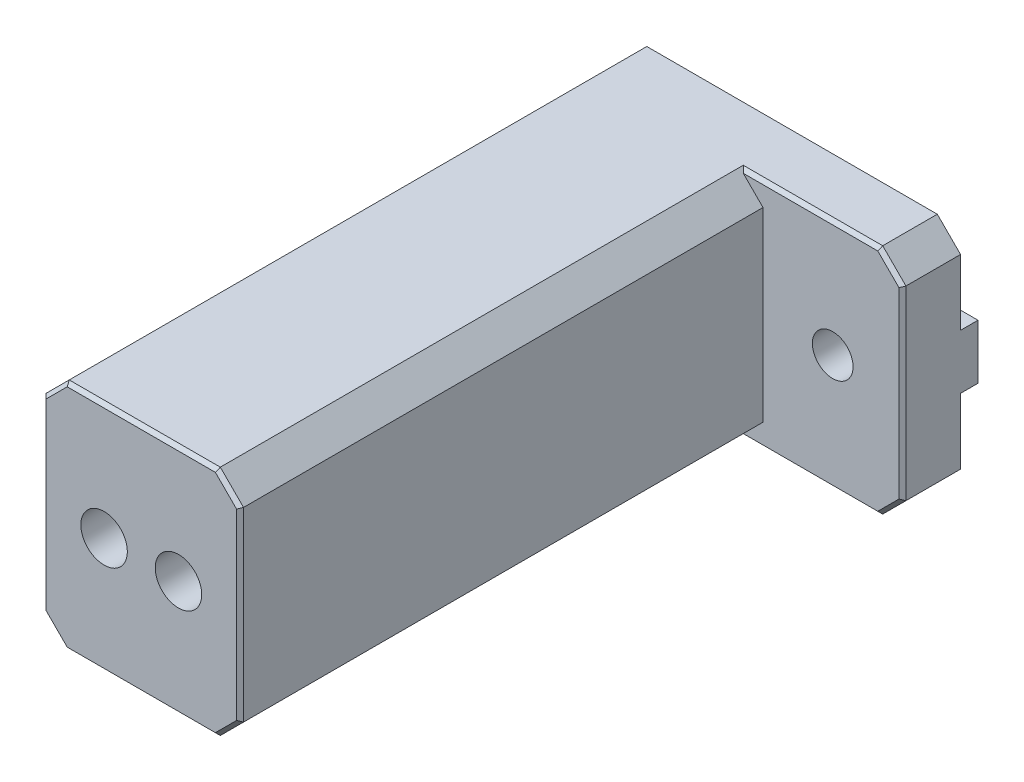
ISO-10303-21;
HEADER;
FILE_DESCRIPTION(('STEP AP214'),'2;1');
FILE_NAME('part.step','',(''),(''),'','','');
FILE_SCHEMA(('AUTOMOTIVE_DESIGN { 1 0 10303 214 1 1 1 1 }'));
ENDSEC;
DATA;
#1=APPLICATION_CONTEXT('core data for automotive mechanical design processes');
#2=APPLICATION_PROTOCOL_DEFINITION('international standard','automotive_design',2000,#1);
#3=PRODUCT_CONTEXT('',#1,'mechanical');
#4=PRODUCT('Part','Part','',(#3));
#5=PRODUCT_RELATED_PRODUCT_CATEGORY('part','',(#4));
#6=PRODUCT_DEFINITION_FORMATION('','',#4);
#7=PRODUCT_DEFINITION_CONTEXT('part definition',#1,'design');
#8=PRODUCT_DEFINITION('design','',#6,#7);
#9=PRODUCT_DEFINITION_SHAPE('','',#8);
#10=(LENGTH_UNIT() NAMED_UNIT(*) SI_UNIT(.MILLI.,.METRE.));
#11=(NAMED_UNIT(*) PLANE_ANGLE_UNIT() SI_UNIT($,.RADIAN.));
#12=(NAMED_UNIT(*) SI_UNIT($,.STERADIAN.) SOLID_ANGLE_UNIT());
#13=UNCERTAINTY_MEASURE_WITH_UNIT(LENGTH_MEASURE(1.E-05),#10,'distance_accuracy_value','');
#14=(GEOMETRIC_REPRESENTATION_CONTEXT(3) GLOBAL_UNCERTAINTY_ASSIGNED_CONTEXT((#13)) GLOBAL_UNIT_ASSIGNED_CONTEXT((#10,
#11,#12)) REPRESENTATION_CONTEXT('',''));
#15=CARTESIAN_POINT('',(0.,0.,0.));
#16=DIRECTION('',(0.,0.,1.));
#17=DIRECTION('',(1.,0.,0.));
#18=AXIS2_PLACEMENT_3D('',#15,#16,#17);
#19=CARTESIAN_POINT('',(14.5,-10.,50.));
#20=DIRECTION('',(-1.,0.,0.));
#21=DIRECTION('',(0.,0.,1.));
#22=AXIS2_PLACEMENT_3D('',#19,#20,#21);
#23=PLANE('',#22);
#24=DIRECTION('',(0.,0.,1.));
#25=VECTOR('',#24,1.);
#26=CARTESIAN_POINT('',(14.5,7.99999999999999,50.));
#27=LINE('',#26,#25);
#28=CARTESIAN_POINT('',(14.5,7.99999999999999,0.));
#29=VERTEX_POINT('',#28);
#30=CARTESIAN_POINT('',(14.5,7.99999999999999,4.7));
#31=VERTEX_POINT('',#30);
#32=EDGE_CURVE('E274',#29,#31,#27,.T.);
#33=ORIENTED_EDGE('',*,*,#32,.T.);
#34=DIRECTION('',(0.,-1.,0.));
#35=VECTOR('',#34,1.);
#36=CARTESIAN_POINT('',(14.5,-8.,4.7));
#37=LINE('',#36,#35);
#38=CARTESIAN_POINT('',(14.5,-8.,4.7));
#39=VERTEX_POINT('',#38);
#40=EDGE_CURVE('E340',#31,#39,#37,.T.);
#41=ORIENTED_EDGE('',*,*,#40,.T.);
#42=DIRECTION('',(0.,0.,-1.));
#43=VECTOR('',#42,1.);
#44=CARTESIAN_POINT('',(14.5,-8.,50.));
#45=LINE('',#44,#43);
#46=CARTESIAN_POINT('',(14.5,-8.,0.));
#47=VERTEX_POINT('',#46);
#48=EDGE_CURVE('E271',#39,#47,#45,.T.);
#49=ORIENTED_EDGE('',*,*,#48,.T.);
#50=DIRECTION('',(0.,1.,0.));
#51=VECTOR('',#50,1.);
#52=CARTESIAN_POINT('',(14.5,-10.,0.));
#53=LINE('',#52,#51);
#54=CARTESIAN_POINT('',(14.5,-2.35,0.));
#55=VERTEX_POINT('',#54);
#56=EDGE_CURVE('E237',#47,#55,#53,.T.);
#57=ORIENTED_EDGE('',*,*,#56,.T.);
#58=DIRECTION('',(0.,0.,1.));
#59=VECTOR('',#58,1.);
#60=CARTESIAN_POINT('',(14.5,-2.35,-1.5));
#61=LINE('',#60,#59);
#62=CARTESIAN_POINT('',(14.5,-2.35,-1.5));
#63=VERTEX_POINT('',#62);
#64=EDGE_CURVE('E239',#63,#55,#61,.T.);
#65=ORIENTED_EDGE('',*,*,#64,.F.);
#66=DIRECTION('',(0.,-1.,0.));
#67=VECTOR('',#66,1.);
#68=CARTESIAN_POINT('',(14.5,-2.35,-1.5));
#69=LINE('',#68,#67);
#70=CARTESIAN_POINT('',(14.5,2.35,-1.5));
#71=VERTEX_POINT('',#70);
#72=EDGE_CURVE('E213',#71,#63,#69,.T.);
#73=ORIENTED_EDGE('',*,*,#72,.F.);
#74=DIRECTION('',(0.,0.,1.));
#75=VECTOR('',#74,1.);
#76=CARTESIAN_POINT('',(14.5,2.35,-1.5));
#77=LINE('',#76,#75);
#78=CARTESIAN_POINT('',(14.5,2.35,0.));
#79=VERTEX_POINT('',#78);
#80=EDGE_CURVE('E209',#71,#79,#77,.T.);
#81=ORIENTED_EDGE('',*,*,#80,.T.);
#82=EDGE_CURVE('E231',#79,#29,#53,.T.);
#83=ORIENTED_EDGE('',*,*,#82,.T.);
#84=EDGE_LOOP('',(#33,#41,#49,#57,#65,#73,#81,#83));
#85=FACE_BOUND('',#84,.T.);
#86=ADVANCED_FACE('F40',(#85),#23,.F.);
#87=CARTESIAN_POINT('',(0.,0.,0.));
#88=DIRECTION('',(0.,0.,-1.));
#89=DIRECTION('',(-1.,0.,0.));
#90=AXIS2_PLACEMENT_3D('',#87,#88,#89);
#91=PLANE('',#90);
#92=ORIENTED_EDGE('',*,*,#56,.F.);
#93=DIRECTION('',(0.707106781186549,0.707106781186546,0.));
#94=VECTOR('',#93,1.);
#95=CARTESIAN_POINT('',(11.25,-11.25,0.));
#96=LINE('',#95,#94);
#97=CARTESIAN_POINT('',(12.5,-10.,0.));
#98=VERTEX_POINT('',#97);
#99=EDGE_CURVE('E281',#47,#98,#96,.F.);
#100=ORIENTED_EDGE('',*,*,#99,.T.);
#101=DIRECTION('',(1.,0.,0.));
#102=VECTOR('',#101,1.);
#103=CARTESIAN_POINT('',(-14.5,-10.,0.));
#104=LINE('',#103,#102);
#105=CARTESIAN_POINT('',(-12.5,-10.,0.));
#106=VERTEX_POINT('',#105);
#107=EDGE_CURVE('E251',#106,#98,#104,.T.);
#108=ORIENTED_EDGE('',*,*,#107,.F.);
#109=DIRECTION('',(0.707106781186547,-0.707106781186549,0.));
#110=VECTOR('',#109,1.);
#111=CARTESIAN_POINT('',(-11.25,-11.25,0.));
#112=LINE('',#111,#110);
#113=CARTESIAN_POINT('',(-14.5,-7.99999999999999,0.));
#114=VERTEX_POINT('',#113);
#115=EDGE_CURVE('E278',#106,#114,#112,.F.);
#116=ORIENTED_EDGE('',*,*,#115,.T.);
#117=DIRECTION('',(0.,-1.,0.));
#118=VECTOR('',#117,1.);
#119=CARTESIAN_POINT('',(-14.5,-10.,0.));
#120=LINE('',#119,#118);
#121=CARTESIAN_POINT('',(-14.5,-2.35,0.));
#122=VERTEX_POINT('',#121);
#123=EDGE_CURVE('E248',#122,#114,#120,.T.);
#124=ORIENTED_EDGE('',*,*,#123,.F.);
#125=DIRECTION('',(-1.,0.,0.));
#126=VECTOR('',#125,1.);
#127=CARTESIAN_POINT('',(14.5,-2.35,0.));
#128=LINE('',#127,#126);
#129=EDGE_CURVE('E224',#55,#122,#128,.T.);
#130=ORIENTED_EDGE('',*,*,#129,.F.);
#131=EDGE_LOOP('',(#92,#100,#108,#116,#124,#130));
#132=FACE_BOUND('',#131,.T.);
#133=ADVANCED_FACE('F493',(#132),#91,.T.);
#134=CARTESIAN_POINT('',(-14.5,10.,50.));
#135=DIRECTION('',(0.,-1.,0.));
#136=DIRECTION('',(0.,0.,-1.));
#137=AXIS2_PLACEMENT_3D('',#134,#135,#136);
#138=PLANE('',#137);
#139=DIRECTION('',(0.,0.,-1.));
#140=VECTOR('',#139,1.);
#141=CARTESIAN_POINT('',(0.499999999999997,10.,50.));
#142=LINE('',#141,#140);
#143=CARTESIAN_POINT('',(0.499999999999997,10.,49.7));
#144=VERTEX_POINT('',#143);
#145=CARTESIAN_POINT('',(0.499999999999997,10.,4.7));
#146=VERTEX_POINT('',#145);
#147=EDGE_CURVE('E255',#144,#146,#142,.T.);
#148=ORIENTED_EDGE('',*,*,#147,.T.);
#149=DIRECTION('',(1.,0.,0.));
#150=VECTOR('',#149,1.);
#151=CARTESIAN_POINT('',(12.5,10.,4.7));
#152=LINE('',#151,#150);
#153=CARTESIAN_POINT('',(12.5,10.,4.7));
#154=VERTEX_POINT('',#153);
#155=EDGE_CURVE('E349',#146,#154,#152,.T.);
#156=ORIENTED_EDGE('',*,*,#155,.T.);
#157=DIRECTION('',(0.,0.,-1.));
#158=VECTOR('',#157,1.);
#159=CARTESIAN_POINT('',(12.5,10.,50.));
#160=LINE('',#159,#158);
#161=CARTESIAN_POINT('',(12.5,10.,0.));
#162=VERTEX_POINT('',#161);
#163=EDGE_CURVE('E262',#154,#162,#160,.T.);
#164=ORIENTED_EDGE('',*,*,#163,.T.);
#165=DIRECTION('',(-1.,0.,0.));
#166=VECTOR('',#165,1.);
#167=CARTESIAN_POINT('',(-14.5,10.,0.));
#168=LINE('',#167,#166);
#169=CARTESIAN_POINT('',(-12.5,10.,0.));
#170=VERTEX_POINT('',#169);
#171=EDGE_CURVE('E244',#162,#170,#168,.T.);
#172=ORIENTED_EDGE('',*,*,#171,.T.);
#173=DIRECTION('',(0.,0.,1.));
#174=VECTOR('',#173,1.);
#175=CARTESIAN_POINT('',(-12.5,10.,50.));
#176=LINE('',#175,#174);
#177=CARTESIAN_POINT('',(-12.5,10.,49.7));
#178=VERTEX_POINT('',#177);
#179=EDGE_CURVE('E258',#170,#178,#176,.T.);
#180=ORIENTED_EDGE('',*,*,#179,.T.);
#181=DIRECTION('',(1.,0.,0.));
#182=VECTOR('',#181,1.);
#183=CARTESIAN_POINT('',(-14.5,10.,49.7));
#184=LINE('',#183,#182);
#185=EDGE_CURVE('E346',#178,#144,#184,.T.);
#186=ORIENTED_EDGE('',*,*,#185,.T.);
#187=EDGE_LOOP('',(#148,#156,#164,#172,#180,#186));
#188=FACE_BOUND('',#187,.T.);
#189=ADVANCED_FACE('F593',(#188),#138,.F.);
#190=CARTESIAN_POINT('',(-14.5,-10.,50.));
#191=DIRECTION('',(1.,0.,0.));
#192=DIRECTION('',(0.,0.,-1.));
#193=AXIS2_PLACEMENT_3D('',#190,#191,#192);
#194=PLANE('',#193);
#195=DIRECTION('',(0.,0.,1.));
#196=VECTOR('',#195,1.);
#197=CARTESIAN_POINT('',(-14.5,-7.99999999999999,50.));
#198=LINE('',#197,#196);
#199=CARTESIAN_POINT('',(-14.5,-7.99999999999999,49.7));
#200=VERTEX_POINT('',#199);
#201=EDGE_CURVE('E298',#114,#200,#198,.T.);
#202=ORIENTED_EDGE('',*,*,#201,.T.);
#203=DIRECTION('',(0.,1.,0.));
#204=VECTOR('',#203,1.);
#205=CARTESIAN_POINT('',(-14.5,-10.,49.7));
#206=LINE('',#205,#204);
#207=CARTESIAN_POINT('',(-14.5,8.,49.7));
#208=VERTEX_POINT('',#207);
#209=EDGE_CURVE('E384',#200,#208,#206,.T.);
#210=ORIENTED_EDGE('',*,*,#209,.T.);
#211=DIRECTION('',(0.,0.,-1.));
#212=VECTOR('',#211,1.);
#213=CARTESIAN_POINT('',(-14.5,8.,50.));
#214=LINE('',#213,#212);
#215=CARTESIAN_POINT('',(-14.5,8.,0.));
#216=VERTEX_POINT('',#215);
#217=EDGE_CURVE('E295',#208,#216,#214,.T.);
#218=ORIENTED_EDGE('',*,*,#217,.T.);
#219=CARTESIAN_POINT('',(-14.5,2.35,0.));
#220=VERTEX_POINT('',#219);
#221=EDGE_CURVE('E228',#216,#220,#120,.T.);
#222=ORIENTED_EDGE('',*,*,#221,.T.);
#223=DIRECTION('',(0.,0.,1.));
#224=VECTOR('',#223,1.);
#225=CARTESIAN_POINT('',(-14.5,2.35,-1.5));
#226=LINE('',#225,#224);
#227=CARTESIAN_POINT('',(-14.5,2.35,-1.5));
#228=VERTEX_POINT('',#227);
#229=EDGE_CURVE('E207',#228,#220,#226,.T.);
#230=ORIENTED_EDGE('',*,*,#229,.F.);
#231=DIRECTION('',(0.,1.,0.));
#232=VECTOR('',#231,1.);
#233=CARTESIAN_POINT('',(-14.5,-2.35,-1.5));
#234=LINE('',#233,#232);
#235=CARTESIAN_POINT('',(-14.5,-2.35,-1.5));
#236=VERTEX_POINT('',#235);
#237=EDGE_CURVE('E214',#236,#228,#234,.T.);
#238=ORIENTED_EDGE('',*,*,#237,.F.);
#239=DIRECTION('',(0.,0.,1.));
#240=VECTOR('',#239,1.);
#241=CARTESIAN_POINT('',(-14.5,-2.35,-1.5));
#242=LINE('',#241,#240);
#243=EDGE_CURVE('E479',#236,#122,#242,.T.);
#244=ORIENTED_EDGE('',*,*,#243,.T.);
#245=ORIENTED_EDGE('',*,*,#123,.T.);
#246=EDGE_LOOP('',(#202,#210,#218,#222,#230,#238,#244,#245));
#247=FACE_BOUND('',#246,.T.);
#248=ADVANCED_FACE('F226',(#247),#194,.F.);
#249=CARTESIAN_POINT('',(-14.5,-10.,50.));
#250=DIRECTION('',(0.,1.,0.));
#251=DIRECTION('',(0.,0.,1.));
#252=AXIS2_PLACEMENT_3D('',#249,#250,#251);
#253=PLANE('',#252);
#254=DIRECTION('',(0.,0.,1.));
#255=VECTOR('',#254,1.);
#256=CARTESIAN_POINT('',(12.5,-10.,50.));
#257=LINE('',#256,#255);
#258=CARTESIAN_POINT('',(12.5,-10.,4.7));
#259=VERTEX_POINT('',#258);
#260=EDGE_CURVE('E291',#98,#259,#257,.T.);
#261=ORIENTED_EDGE('',*,*,#260,.T.);
#262=DIRECTION('',(-1.,0.,0.));
#263=VECTOR('',#262,1.);
#264=CARTESIAN_POINT('',(0.500000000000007,-10.,4.7));
#265=LINE('',#264,#263);
#266=CARTESIAN_POINT('',(0.500000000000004,-10.,4.7));
#267=VERTEX_POINT('',#266);
#268=EDGE_CURVE('E333',#259,#267,#265,.T.);
#269=ORIENTED_EDGE('',*,*,#268,.T.);
#270=DIRECTION('',(0.,0.,1.));
#271=VECTOR('',#270,1.);
#272=CARTESIAN_POINT('',(0.500000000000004,-10.,50.));
#273=LINE('',#272,#271);
#274=CARTESIAN_POINT('',(0.500000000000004,-10.,49.7));
#275=VERTEX_POINT('',#274);
#276=EDGE_CURVE('E284',#267,#275,#273,.T.);
#277=ORIENTED_EDGE('',*,*,#276,.T.);
#278=DIRECTION('',(-1.,0.,0.));
#279=VECTOR('',#278,1.);
#280=CARTESIAN_POINT('',(-14.5,-10.,49.7));
#281=LINE('',#280,#279);
#282=CARTESIAN_POINT('',(-12.5,-10.,49.7));
#283=VERTEX_POINT('',#282);
#284=EDGE_CURVE('E330',#275,#283,#281,.T.);
#285=ORIENTED_EDGE('',*,*,#284,.T.);
#286=DIRECTION('',(0.,0.,-1.));
#287=VECTOR('',#286,1.);
#288=CARTESIAN_POINT('',(-12.5,-10.,50.));
#289=LINE('',#288,#287);
#290=EDGE_CURVE('E288',#283,#106,#289,.T.);
#291=ORIENTED_EDGE('',*,*,#290,.T.);
#292=ORIENTED_EDGE('',*,*,#107,.T.);
#293=EDGE_LOOP('',(#261,#269,#277,#285,#291,#292));
#294=FACE_BOUND('',#293,.T.);
#295=ADVANCED_FACE('F552',(#294),#253,.F.);
#296=CARTESIAN_POINT('',(0.,0.,50.));
#297=DIRECTION('',(0.,0.,-1.));
#298=DIRECTION('',(-1.,0.,0.));
#299=AXIS2_PLACEMENT_3D('',#296,#297,#298);
#300=PLANE('',#299);
#301=DIRECTION('',(0.,1.,0.));
#302=VECTOR('',#301,1.);
#303=CARTESIAN_POINT('',(2.2,0.,50.));
#304=LINE('',#303,#302);
#305=CARTESIAN_POINT('',(2.2,-7.87573593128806,50.));
#306=VERTEX_POINT('',#305);
#307=CARTESIAN_POINT('',(2.2,7.87573593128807,50.));
#308=VERTEX_POINT('',#307);
#309=EDGE_CURVE('E358',#306,#308,#304,.T.);
#310=ORIENTED_EDGE('',*,*,#309,.T.);
#311=DIRECTION('',(-0.707106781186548,0.707106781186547,0.));
#312=VECTOR('',#311,1.);
#313=CARTESIAN_POINT('',(0.287867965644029,9.78786796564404,50.));
#314=LINE('',#313,#312);
#315=CARTESIAN_POINT('',(0.375735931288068,9.7,50.));
#316=VERTEX_POINT('',#315);
#317=EDGE_CURVE('E373',#308,#316,#314,.T.);
#318=ORIENTED_EDGE('',*,*,#317,.T.);
#319=DIRECTION('',(-1.,0.,0.));
#320=VECTOR('',#319,1.);
#321=CARTESIAN_POINT('',(0.,9.7,50.));
#322=LINE('',#321,#320);
#323=CARTESIAN_POINT('',(-12.3757359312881,9.7,50.));
#324=VERTEX_POINT('',#323);
#325=EDGE_CURVE('E370',#316,#324,#322,.T.);
#326=ORIENTED_EDGE('',*,*,#325,.T.);
#327=DIRECTION('',(-0.707106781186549,-0.707106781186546,0.));
#328=VECTOR('',#327,1.);
#329=CARTESIAN_POINT('',(-14.287867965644,7.78786796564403,50.));
#330=LINE('',#329,#328);
#331=CARTESIAN_POINT('',(-14.2,7.87573593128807,50.));
#332=VERTEX_POINT('',#331);
#333=EDGE_CURVE('E367',#324,#332,#330,.T.);
#334=ORIENTED_EDGE('',*,*,#333,.T.);
#335=DIRECTION('',(0.,-1.,0.));
#336=VECTOR('',#335,1.);
#337=CARTESIAN_POINT('',(-14.2,0.,50.));
#338=LINE('',#337,#336);
#339=CARTESIAN_POINT('',(-14.2,-7.87573593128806,50.));
#340=VERTEX_POINT('',#339);
#341=EDGE_CURVE('E364',#332,#340,#338,.T.);
#342=ORIENTED_EDGE('',*,*,#341,.T.);
#343=DIRECTION('',(0.707106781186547,-0.707106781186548,0.));
#344=VECTOR('',#343,1.);
#345=CARTESIAN_POINT('',(-12.287867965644,-9.78786796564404,50.));
#346=LINE('',#345,#344);
#347=CARTESIAN_POINT('',(-12.3757359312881,-9.7,50.));
#348=VERTEX_POINT('',#347);
#349=EDGE_CURVE('E361',#340,#348,#346,.T.);
#350=ORIENTED_EDGE('',*,*,#349,.T.);
#351=DIRECTION('',(1.,0.,0.));
#352=VECTOR('',#351,1.);
#353=CARTESIAN_POINT('',(0.,-9.7,50.));
#354=LINE('',#353,#352);
#355=CARTESIAN_POINT('',(0.375735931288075,-9.7,50.));
#356=VERTEX_POINT('',#355);
#357=EDGE_CURVE('E352',#348,#356,#354,.T.);
#358=ORIENTED_EDGE('',*,*,#357,.T.);
#359=DIRECTION('',(0.707106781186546,0.707106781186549,0.));
#360=VECTOR('',#359,1.);
#361=CARTESIAN_POINT('',(2.28786796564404,-7.78786796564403,50.));
#362=LINE('',#361,#360);
#363=EDGE_CURVE('E355',#356,#306,#362,.T.);
#364=ORIENTED_EDGE('',*,*,#363,.T.);
#365=EDGE_LOOP('',(#310,#318,#326,#334,#342,#350,#358,#364));
#366=FACE_BOUND('',#365,.T.);
#367=CARTESIAN_POINT('',(-9.2,0.,50.));
#368=DIRECTION('',(0.,0.,1.));
#369=DIRECTION('',(1.,0.,0.));
#370=AXIS2_PLACEMENT_3D('',#367,#368,#369);
#371=CIRCLE('',#370,1.99999999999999);
#372=CARTESIAN_POINT('',(-7.20000000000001,0.,50.));
#373=VERTEX_POINT('',#372);
#374=EDGE_CURVE('E700',#373,#373,#371,.T.);
#375=ORIENTED_EDGE('',*,*,#374,.F.);
#376=EDGE_LOOP('',(#375));
#377=FACE_BOUND('',#376,.T.);
#378=CARTESIAN_POINT('',(-2.8,0.,50.));
#379=DIRECTION('',(0.,0.,1.));
#380=DIRECTION('',(1.,0.,0.));
#381=AXIS2_PLACEMENT_3D('',#378,#379,#380);
#382=CIRCLE('',#381,1.99999999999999);
#383=CARTESIAN_POINT('',(-0.800000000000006,0.,50.));
#384=VERTEX_POINT('',#383);
#385=EDGE_CURVE('E474',#384,#384,#382,.T.);
#386=ORIENTED_EDGE('',*,*,#385,.F.);
#387=EDGE_LOOP('',(#386));
#388=FACE_BOUND('',#387,.T.);
#389=ADVANCED_FACE('F580',(#366,#377,#388),#300,.F.);
#390=ORIENTED_EDGE('',*,*,#171,.F.);
#391=DIRECTION('',(-0.707106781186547,0.707106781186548,0.));
#392=VECTOR('',#391,1.);
#393=CARTESIAN_POINT('',(11.25,11.25,0.));
#394=LINE('',#393,#392);
#395=EDGE_CURVE('E268',#162,#29,#394,.F.);
#396=ORIENTED_EDGE('',*,*,#395,.T.);
#397=ORIENTED_EDGE('',*,*,#82,.F.);
#398=DIRECTION('',(1.,0.,0.));
#399=VECTOR('',#398,1.);
#400=CARTESIAN_POINT('',(14.5,2.35,0.));
#401=LINE('',#400,#399);
#402=EDGE_CURVE('E464',#220,#79,#401,.T.);
#403=ORIENTED_EDGE('',*,*,#402,.F.);
#404=ORIENTED_EDGE('',*,*,#221,.F.);
#405=DIRECTION('',(-0.707106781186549,-0.707106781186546,0.));
#406=VECTOR('',#405,1.);
#407=CARTESIAN_POINT('',(-11.25,11.25,0.));
#408=LINE('',#407,#406);
#409=EDGE_CURVE('E265',#216,#170,#408,.F.);
#410=ORIENTED_EDGE('',*,*,#409,.T.);
#411=EDGE_LOOP('',(#390,#396,#397,#403,#404,#410));
#412=FACE_BOUND('',#411,.T.);
#413=ADVANCED_FACE('F463',(#412),#91,.T.);
#414=CARTESIAN_POINT('',(14.5,2.35,-1.5));
#415=DIRECTION('',(0.,-1.,0.));
#416=DIRECTION('',(0.,0.,-1.));
#417=AXIS2_PLACEMENT_3D('',#414,#415,#416);
#418=PLANE('',#417);
#419=ORIENTED_EDGE('',*,*,#402,.T.);
#420=ORIENTED_EDGE('',*,*,#80,.F.);
#421=DIRECTION('',(1.,0.,0.));
#422=VECTOR('',#421,1.);
#423=CARTESIAN_POINT('',(14.5,2.35,-1.5));
#424=LINE('',#423,#422);
#425=EDGE_CURVE('E202',#228,#71,#424,.T.);
#426=ORIENTED_EDGE('',*,*,#425,.F.);
#427=ORIENTED_EDGE('',*,*,#229,.T.);
#428=EDGE_LOOP('',(#419,#420,#426,#427));
#429=FACE_BOUND('',#428,.T.);
#430=ADVANCED_FACE('F205',(#429),#418,.F.);
#431=CARTESIAN_POINT('',(14.5,-2.35,-1.5));
#432=DIRECTION('',(0.,1.,0.));
#433=DIRECTION('',(0.,0.,1.));
#434=AXIS2_PLACEMENT_3D('',#431,#432,#433);
#435=PLANE('',#434);
#436=ORIENTED_EDGE('',*,*,#129,.T.);
#437=ORIENTED_EDGE('',*,*,#243,.F.);
#438=DIRECTION('',(-1.,0.,0.));
#439=VECTOR('',#438,1.);
#440=CARTESIAN_POINT('',(14.5,-2.35,-1.5));
#441=LINE('',#440,#439);
#442=EDGE_CURVE('E219',#63,#236,#441,.T.);
#443=ORIENTED_EDGE('',*,*,#442,.F.);
#444=ORIENTED_EDGE('',*,*,#64,.T.);
#445=EDGE_LOOP('',(#436,#437,#443,#444));
#446=FACE_BOUND('',#445,.T.);
#447=ADVANCED_FACE('F486',(#446),#435,.F.);
#448=CARTESIAN_POINT('',(0.,0.,-1.5));
#449=DIRECTION('',(0.,0.,1.));
#450=DIRECTION('',(1.,0.,0.));
#451=AXIS2_PLACEMENT_3D('',#448,#449,#450);
#452=PLANE('',#451);
#453=CARTESIAN_POINT('',(8.5,0.,-1.5));
#454=DIRECTION('',(0.,0.,1.));
#455=DIRECTION('',(1.,0.,0.));
#456=AXIS2_PLACEMENT_3D('',#453,#454,#455);
#457=CIRCLE('',#456,1.75);
#458=CARTESIAN_POINT('',(10.25,0.,-1.5));
#459=VERTEX_POINT('',#458);
#460=EDGE_CURVE('E701',#459,#459,#457,.T.);
#461=ORIENTED_EDGE('',*,*,#460,.T.);
#462=EDGE_LOOP('',(#461));
#463=FACE_BOUND('',#462,.T.);
#464=ORIENTED_EDGE('',*,*,#237,.T.);
#465=ORIENTED_EDGE('',*,*,#425,.T.);
#466=ORIENTED_EDGE('',*,*,#72,.T.);
#467=ORIENTED_EDGE('',*,*,#442,.T.);
#468=EDGE_LOOP('',(#464,#465,#466,#467));
#469=FACE_BOUND('',#468,.T.);
#470=ADVANCED_FACE('F217',(#463,#469),#452,.F.);
#471=CARTESIAN_POINT('',(-2.8,0.,41.));
#472=DIRECTION('',(0.,0.,-1.));
#473=DIRECTION('',(-1.,0.,0.));
#474=AXIS2_PLACEMENT_3D('',#471,#472,#473);
#475=PLANE('',#474);
#476=CARTESIAN_POINT('',(-2.8,0.,41.));
#477=DIRECTION('',(0.,0.,1.));
#478=DIRECTION('',(1.,0.,0.));
#479=AXIS2_PLACEMENT_3D('',#476,#477,#478);
#480=CIRCLE('',#479,1.99999999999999);
#481=CARTESIAN_POINT('',(-0.800000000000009,0.,41.));
#482=VERTEX_POINT('',#481);
#483=EDGE_CURVE('E466',#482,#482,#480,.T.);
#484=ORIENTED_EDGE('',*,*,#483,.T.);
#485=EDGE_LOOP('',(#484));
#486=FACE_BOUND('',#485,.T.);
#487=ADVANCED_FACE('F1020',(#486),#475,.F.);
#488=CARTESIAN_POINT('',(-2.8,0.,50.));
#489=DIRECTION('',(0.,0.,1.));
#490=DIRECTION('',(1.,0.,0.));
#491=AXIS2_PLACEMENT_3D('',#488,#489,#490);
#492=CYLINDRICAL_SURFACE('',#491,1.99999999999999);
#493=ORIENTED_EDGE('',*,*,#483,.F.);
#494=EDGE_LOOP('',(#493));
#495=FACE_BOUND('',#494,.T.);
#496=ORIENTED_EDGE('',*,*,#385,.T.);
#497=EDGE_LOOP('',(#496));
#498=FACE_BOUND('',#497,.T.);
#499=ADVANCED_FACE('F729',(#495,#498),#492,.F.);
#500=CARTESIAN_POINT('',(-9.2,0.,41.));
#501=DIRECTION('',(0.,0.,-1.));
#502=DIRECTION('',(-1.,0.,0.));
#503=AXIS2_PLACEMENT_3D('',#500,#501,#502);
#504=PLANE('',#503);
#505=CARTESIAN_POINT('',(-9.2,0.,41.));
#506=DIRECTION('',(0.,0.,1.));
#507=DIRECTION('',(1.,0.,0.));
#508=AXIS2_PLACEMENT_3D('',#505,#506,#507);
#509=CIRCLE('',#508,1.99999999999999);
#510=CARTESIAN_POINT('',(-7.20000000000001,0.,41.));
#511=VERTEX_POINT('',#510);
#512=EDGE_CURVE('E707',#511,#511,#509,.T.);
#513=ORIENTED_EDGE('',*,*,#512,.T.);
#514=EDGE_LOOP('',(#513));
#515=FACE_BOUND('',#514,.T.);
#516=ADVANCED_FACE('F1005',(#515),#504,.F.);
#517=CARTESIAN_POINT('',(-9.2,0.,50.));
#518=DIRECTION('',(0.,0.,1.));
#519=DIRECTION('',(1.,0.,0.));
#520=AXIS2_PLACEMENT_3D('',#517,#518,#519);
#521=CYLINDRICAL_SURFACE('',#520,1.99999999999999);
#522=ORIENTED_EDGE('',*,*,#512,.F.);
#523=EDGE_LOOP('',(#522));
#524=FACE_BOUND('',#523,.T.);
#525=ORIENTED_EDGE('',*,*,#374,.T.);
#526=EDGE_LOOP('',(#525));
#527=FACE_BOUND('',#526,.T.);
#528=ADVANCED_FACE('F798',(#524,#527),#521,.F.);
#529=CARTESIAN_POINT('',(2.5,-10.,5.));
#530=DIRECTION('',(-1.,0.,0.));
#531=DIRECTION('',(0.,0.,1.));
#532=AXIS2_PLACEMENT_3D('',#529,#530,#531);
#533=PLANE('',#532);
#534=DIRECTION('',(0.,0.,1.));
#535=VECTOR('',#534,1.);
#536=CARTESIAN_POINT('',(2.5,8.,5.));
#537=LINE('',#536,#535);
#538=CARTESIAN_POINT('',(2.5,8.,5.));
#539=VERTEX_POINT('',#538);
#540=CARTESIAN_POINT('',(2.5,8.,49.7));
#541=VERTEX_POINT('',#540);
#542=EDGE_CURVE('E301',#539,#541,#537,.T.);
#543=ORIENTED_EDGE('',*,*,#542,.T.);
#544=DIRECTION('',(0.,-1.,0.));
#545=VECTOR('',#544,1.);
#546=CARTESIAN_POINT('',(2.5,-10.,49.7));
#547=LINE('',#546,#545);
#548=CARTESIAN_POINT('',(2.5,-7.99999999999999,49.7));
#549=VERTEX_POINT('',#548);
#550=EDGE_CURVE('E59',#541,#549,#547,.T.);
#551=ORIENTED_EDGE('',*,*,#550,.T.);
#552=DIRECTION('',(0.,0.,-1.));
#553=VECTOR('',#552,1.);
#554=CARTESIAN_POINT('',(2.5,-7.99999999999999,5.));
#555=LINE('',#554,#553);
#556=CARTESIAN_POINT('',(2.5,-7.99999999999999,5.));
#557=VERTEX_POINT('',#556);
#558=EDGE_CURVE('E304',#549,#557,#555,.T.);
#559=ORIENTED_EDGE('',*,*,#558,.T.);
#560=DIRECTION('',(0.,-1.,0.));
#561=VECTOR('',#560,1.);
#562=CARTESIAN_POINT('',(2.5,-10.,5.));
#563=LINE('',#562,#561);
#564=EDGE_CURVE('E698',#539,#557,#563,.T.);
#565=ORIENTED_EDGE('',*,*,#564,.F.);
#566=EDGE_LOOP('',(#543,#551,#559,#565));
#567=FACE_BOUND('',#566,.T.);
#568=ADVANCED_FACE('F793',(#567),#533,.F.);
#569=CARTESIAN_POINT('',(0.,0.,5.));
#570=DIRECTION('',(0.,0.,1.));
#571=DIRECTION('',(1.,0.,0.));
#572=AXIS2_PLACEMENT_3D('',#569,#570,#571);
#573=PLANE('',#572);
#574=CARTESIAN_POINT('',(8.5,0.,5.00000000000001));
#575=DIRECTION('',(0.,0.,1.));
#576=DIRECTION('',(1.,0.,0.));
#577=AXIS2_PLACEMENT_3D('',#574,#575,#576);
#578=CIRCLE('',#577,1.74999999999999);
#579=CARTESIAN_POINT('',(10.25,0.,5.00000000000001));
#580=VERTEX_POINT('',#579);
#581=EDGE_CURVE('E411',#580,#580,#578,.T.);
#582=ORIENTED_EDGE('',*,*,#581,.F.);
#583=EDGE_LOOP('',(#582));
#584=FACE_BOUND('',#583,.T.);
#585=DIRECTION('',(0.707106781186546,0.707106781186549,0.));
#586=VECTOR('',#585,1.);
#587=CARTESIAN_POINT('',(0.500000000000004,-10.,5.));
#588=LINE('',#587,#586);
#589=CARTESIAN_POINT('',(0.800000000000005,-9.7,5.));
#590=VERTEX_POINT('',#589);
#591=EDGE_CURVE('E307',#557,#590,#588,.F.);
#592=ORIENTED_EDGE('',*,*,#591,.T.);
#593=DIRECTION('',(1.,0.,0.));
#594=VECTOR('',#593,1.);
#595=CARTESIAN_POINT('',(12.5,-9.7,5.));
#596=LINE('',#595,#594);
#597=CARTESIAN_POINT('',(12.3757359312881,-9.7,5.));
#598=VERTEX_POINT('',#597);
#599=EDGE_CURVE('E326',#590,#598,#596,.T.);
#600=ORIENTED_EDGE('',*,*,#599,.T.);
#601=DIRECTION('',(0.707106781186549,0.707106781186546,0.));
#602=VECTOR('',#601,1.);
#603=CARTESIAN_POINT('',(11.037867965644,-11.0378679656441,5.));
#604=LINE('',#603,#602);
#605=CARTESIAN_POINT('',(14.2,-7.87573593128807,5.));
#606=VERTEX_POINT('',#605);
#607=EDGE_CURVE('E323',#598,#606,#604,.T.);
#608=ORIENTED_EDGE('',*,*,#607,.T.);
#609=DIRECTION('',(0.,1.,0.));
#610=VECTOR('',#609,1.);
#611=CARTESIAN_POINT('',(14.2,7.99999999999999,5.));
#612=LINE('',#611,#610);
#613=CARTESIAN_POINT('',(14.2,7.87573593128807,5.));
#614=VERTEX_POINT('',#613);
#615=EDGE_CURVE('E320',#606,#614,#612,.T.);
#616=ORIENTED_EDGE('',*,*,#615,.T.);
#617=DIRECTION('',(-0.707106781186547,0.707106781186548,0.));
#618=VECTOR('',#617,1.);
#619=CARTESIAN_POINT('',(11.037867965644,11.037867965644,5.));
#620=LINE('',#619,#618);
#621=CARTESIAN_POINT('',(12.3757359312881,9.7,5.));
#622=VERTEX_POINT('',#621);
#623=EDGE_CURVE('E317',#614,#622,#620,.T.);
#624=ORIENTED_EDGE('',*,*,#623,.T.);
#625=DIRECTION('',(-1.,0.,0.));
#626=VECTOR('',#625,1.);
#627=CARTESIAN_POINT('',(0.5,9.7,5.));
#628=LINE('',#627,#626);
#629=CARTESIAN_POINT('',(0.799999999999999,9.7,5.));
#630=VERTEX_POINT('',#629);
#631=EDGE_CURVE('E314',#622,#630,#628,.T.);
#632=ORIENTED_EDGE('',*,*,#631,.T.);
#633=DIRECTION('',(-0.707106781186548,0.707106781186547,0.));
#634=VECTOR('',#633,1.);
#635=CARTESIAN_POINT('',(2.5,8.,5.));
#636=LINE('',#635,#634);
#637=EDGE_CURVE('E311',#630,#539,#636,.F.);
#638=ORIENTED_EDGE('',*,*,#637,.T.);
#639=ORIENTED_EDGE('',*,*,#564,.T.);
#640=EDGE_LOOP('',(#592,#600,#608,#616,#624,#632,#638,#639));
#641=FACE_BOUND('',#640,.T.);
#642=ADVANCED_FACE('F695',(#584,#641),#573,.T.);
#643=CARTESIAN_POINT('',(8.5,0.,5.));
#644=DIRECTION('',(0.,0.,1.));
#645=DIRECTION('',(1.,0.,0.));
#646=AXIS2_PLACEMENT_3D('',#643,#644,#645);
#647=CYLINDRICAL_SURFACE('',#646,1.74999999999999);
#648=ORIENTED_EDGE('',*,*,#460,.F.);
#649=EDGE_LOOP('',(#648));
#650=FACE_BOUND('',#649,.T.);
#651=ORIENTED_EDGE('',*,*,#581,.T.);
#652=EDGE_LOOP('',(#651));
#653=FACE_BOUND('',#652,.T.);
#654=ADVANCED_FACE('F627',(#650,#653),#647,.F.);
#655=CARTESIAN_POINT('',(12.5,10.,50.));
#656=DIRECTION('',(-0.707106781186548,-0.707106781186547,0.));
#657=DIRECTION('',(0.,0.,-1.));
#658=AXIS2_PLACEMENT_3D('',#655,#656,#657);
#659=PLANE('',#658);
#660=ORIENTED_EDGE('',*,*,#163,.F.);
#661=DIRECTION('',(-0.707106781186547,0.707106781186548,0.));
#662=VECTOR('',#661,1.);
#663=CARTESIAN_POINT('',(12.5,10.,4.7));
#664=LINE('',#663,#662);
#665=EDGE_CURVE('E343',#154,#31,#664,.F.);
#666=ORIENTED_EDGE('',*,*,#665,.T.);
#667=ORIENTED_EDGE('',*,*,#32,.F.);
#668=ORIENTED_EDGE('',*,*,#395,.F.);
#669=EDGE_LOOP('',(#660,#666,#667,#668));
#670=FACE_BOUND('',#669,.T.);
#671=ADVANCED_FACE('F621',(#670),#659,.F.);
#672=CARTESIAN_POINT('',(14.5,-8.,50.));
#673=DIRECTION('',(-0.707106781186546,0.707106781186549,0.));
#674=DIRECTION('',(0.,0.,-1.));
#675=AXIS2_PLACEMENT_3D('',#672,#673,#674);
#676=PLANE('',#675);
#677=ORIENTED_EDGE('',*,*,#48,.F.);
#678=DIRECTION('',(0.707106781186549,0.707106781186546,0.));
#679=VECTOR('',#678,1.);
#680=CARTESIAN_POINT('',(14.5,-8.,4.7));
#681=LINE('',#680,#679);
#682=EDGE_CURVE('E337',#39,#259,#681,.F.);
#683=ORIENTED_EDGE('',*,*,#682,.T.);
#684=ORIENTED_EDGE('',*,*,#260,.F.);
#685=ORIENTED_EDGE('',*,*,#99,.F.);
#686=EDGE_LOOP('',(#677,#683,#684,#685));
#687=FACE_BOUND('',#686,.T.);
#688=ADVANCED_FACE('F555',(#687),#676,.F.);
#689=CARTESIAN_POINT('',(-12.5,-10.,50.));
#690=DIRECTION('',(0.707106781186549,0.707106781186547,0.));
#691=DIRECTION('',(0.,0.,-1.));
#692=AXIS2_PLACEMENT_3D('',#689,#690,#691);
#693=PLANE('',#692);
#694=ORIENTED_EDGE('',*,*,#290,.F.);
#695=DIRECTION('',(0.707106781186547,-0.707106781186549,0.));
#696=VECTOR('',#695,1.);
#697=CARTESIAN_POINT('',(-14.5,-7.99999999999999,49.7));
#698=LINE('',#697,#696);
#699=EDGE_CURVE('E67',#283,#200,#698,.F.);
#700=ORIENTED_EDGE('',*,*,#699,.T.);
#701=ORIENTED_EDGE('',*,*,#201,.F.);
#702=ORIENTED_EDGE('',*,*,#115,.F.);
#703=EDGE_LOOP('',(#694,#700,#701,#702));
#704=FACE_BOUND('',#703,.T.);
#705=ADVANCED_FACE('F549',(#704),#693,.F.);
#706=CARTESIAN_POINT('',(0.500000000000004,-10.,50.));
#707=DIRECTION('',(-0.707106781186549,0.707106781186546,0.));
#708=DIRECTION('',(0.,0.,1.));
#709=AXIS2_PLACEMENT_3D('',#706,#707,#708);
#710=PLANE('',#709);
#711=ORIENTED_EDGE('',*,*,#558,.F.);
#712=DIRECTION('',(0.707106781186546,0.707106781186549,0.));
#713=VECTOR('',#712,1.);
#714=CARTESIAN_POINT('',(0.500000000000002,-10.,49.7));
#715=LINE('',#714,#713);
#716=EDGE_CURVE('E391',#549,#275,#715,.F.);
#717=ORIENTED_EDGE('',*,*,#716,.T.);
#718=ORIENTED_EDGE('',*,*,#276,.F.);
#719=DIRECTION('',(-0.577350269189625,-0.577350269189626,-0.577350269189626));
#720=VECTOR('',#719,1.);
#721=CARTESIAN_POINT('',(0.533333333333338,-9.96666666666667,4.73333333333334));
#722=LINE('',#721,#720);
#723=EDGE_CURVE('E51',#267,#590,#722,.F.);
#724=ORIENTED_EDGE('',*,*,#723,.T.);
#725=ORIENTED_EDGE('',*,*,#591,.F.);
#726=EDGE_LOOP('',(#711,#717,#718,#724,#725));
#727=FACE_BOUND('',#726,.T.);
#728=ADVANCED_FACE('F567',(#727),#710,.F.);
#729=CARTESIAN_POINT('',(-14.5,8.,50.));
#730=DIRECTION('',(0.707106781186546,-0.707106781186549,0.));
#731=DIRECTION('',(0.,0.,-1.));
#732=AXIS2_PLACEMENT_3D('',#729,#730,#731);
#733=PLANE('',#732);
#734=ORIENTED_EDGE('',*,*,#217,.F.);
#735=DIRECTION('',(-0.707106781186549,-0.707106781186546,0.));
#736=VECTOR('',#735,1.);
#737=CARTESIAN_POINT('',(-12.5,10.,49.7));
#738=LINE('',#737,#736);
#739=EDGE_CURVE('E381',#208,#178,#738,.F.);
#740=ORIENTED_EDGE('',*,*,#739,.T.);
#741=ORIENTED_EDGE('',*,*,#179,.F.);
#742=ORIENTED_EDGE('',*,*,#409,.F.);
#743=EDGE_LOOP('',(#734,#740,#741,#742));
#744=FACE_BOUND('',#743,.T.);
#745=ADVANCED_FACE('F459',(#744),#733,.F.);
#746=CARTESIAN_POINT('',(2.5,8.,5.));
#747=DIRECTION('',(-0.707106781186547,-0.707106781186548,0.));
#748=DIRECTION('',(0.,0.,1.));
#749=AXIS2_PLACEMENT_3D('',#746,#747,#748);
#750=PLANE('',#749);
#751=ORIENTED_EDGE('',*,*,#147,.F.);
#752=DIRECTION('',(-0.707106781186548,0.707106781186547,0.));
#753=VECTOR('',#752,1.);
#754=CARTESIAN_POINT('',(2.5,8.,49.7));
#755=LINE('',#754,#753);
#756=EDGE_CURVE('E377',#144,#541,#755,.F.);
#757=ORIENTED_EDGE('',*,*,#756,.T.);
#758=ORIENTED_EDGE('',*,*,#542,.F.);
#759=ORIENTED_EDGE('',*,*,#637,.F.);
#760=DIRECTION('',(0.577350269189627,-0.577350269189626,0.577350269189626));
#761=VECTOR('',#760,1.);
#762=CARTESIAN_POINT('',(0.533333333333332,9.96666666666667,4.73333333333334));
#763=LINE('',#762,#761);
#764=EDGE_CURVE('E11',#630,#146,#763,.F.);
#765=ORIENTED_EDGE('',*,*,#764,.T.);
#766=EDGE_LOOP('',(#751,#757,#758,#759,#765));
#767=FACE_BOUND('',#766,.T.);
#768=ADVANCED_FACE('F596',(#767),#750,.F.);
#769=CARTESIAN_POINT('',(0.,9.7,5.));
#770=DIRECTION('',(0.,0.707106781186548,0.707106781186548));
#771=DIRECTION('',(1.,0.,0.));
#772=AXIS2_PLACEMENT_3D('',#769,#770,#771);
#773=PLANE('',#772);
#774=ORIENTED_EDGE('',*,*,#764,.F.);
#775=ORIENTED_EDGE('',*,*,#631,.F.);
#776=DIRECTION('',(0.281084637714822,0.678598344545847,-0.678598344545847));
#777=VECTOR('',#776,1.);
#778=CARTESIAN_POINT('',(11.3979466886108,7.33940794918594,7.36059205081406));
#779=LINE('',#778,#777);
#780=EDGE_CURVE('E407',#154,#622,#779,.F.);
#781=ORIENTED_EDGE('',*,*,#780,.F.);
#782=ORIENTED_EDGE('',*,*,#155,.F.);
#783=EDGE_LOOP('',(#774,#775,#781,#782));
#784=FACE_BOUND('',#783,.T.);
#785=ADVANCED_FACE('F654',(#784),#773,.T.);
#786=CARTESIAN_POINT('',(11.037867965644,11.037867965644,5.));
#787=DIRECTION('',(0.5,0.499999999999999,0.707106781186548));
#788=DIRECTION('',(0.707106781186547,-0.707106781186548,0.));
#789=AXIS2_PLACEMENT_3D('',#786,#787,#788);
#790=PLANE('',#789);
#791=ORIENTED_EDGE('',*,*,#780,.T.);
#792=ORIENTED_EDGE('',*,*,#623,.F.);
#793=DIRECTION('',(0.678598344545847,0.281084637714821,-0.678598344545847));
#794=VECTOR('',#793,1.);
#795=CARTESIAN_POINT('',(13.3470081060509,7.52241512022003,5.85299189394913));
#796=LINE('',#795,#794);
#797=EDGE_CURVE('E403',#31,#614,#796,.F.);
#798=ORIENTED_EDGE('',*,*,#797,.F.);
#799=ORIENTED_EDGE('',*,*,#665,.F.);
#800=EDGE_LOOP('',(#791,#792,#798,#799));
#801=FACE_BOUND('',#800,.T.);
#802=ADVANCED_FACE('F672',(#801),#790,.T.);
#803=CARTESIAN_POINT('',(14.2,0.,5.));
#804=DIRECTION('',(0.707106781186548,0.,0.707106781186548));
#805=DIRECTION('',(0.,-1.,0.));
#806=AXIS2_PLACEMENT_3D('',#803,#804,#805);
#807=PLANE('',#806);
#808=ORIENTED_EDGE('',*,*,#797,.T.);
#809=ORIENTED_EDGE('',*,*,#615,.F.);
#810=DIRECTION('',(0.678598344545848,-0.281084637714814,-0.678598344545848));
#811=VECTOR('',#810,1.);
#812=CARTESIAN_POINT('',(12.6977540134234,-7.25348526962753,6.50224598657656));
#813=LINE('',#812,#811);
#814=EDGE_CURVE('E399',#39,#606,#813,.F.);
#815=ORIENTED_EDGE('',*,*,#814,.F.);
#816=ORIENTED_EDGE('',*,*,#40,.F.);
#817=EDGE_LOOP('',(#808,#809,#815,#816));
#818=FACE_BOUND('',#817,.T.);
#819=ADVANCED_FACE('F666',(#818),#807,.T.);
#820=CARTESIAN_POINT('',(11.037867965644,-11.0378679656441,5.));
#821=DIRECTION('',(0.500000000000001,-0.500000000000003,0.707106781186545));
#822=DIRECTION('',(-0.707106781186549,-0.707106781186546,0.));
#823=AXIS2_PLACEMENT_3D('',#820,#821,#822);
#824=PLANE('',#823);
#825=ORIENTED_EDGE('',*,*,#814,.T.);
#826=ORIENTED_EDGE('',*,*,#607,.F.);
#827=DIRECTION('',(0.281084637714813,-0.678598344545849,-0.678598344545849));
#828=VECTOR('',#827,1.);
#829=CARTESIAN_POINT('',(12.5252226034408,-10.0608927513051,4.63910724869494));
#830=LINE('',#829,#828);
#831=EDGE_CURVE('E396',#259,#598,#830,.F.);
#832=ORIENTED_EDGE('',*,*,#831,.F.);
#833=ORIENTED_EDGE('',*,*,#682,.F.);
#834=EDGE_LOOP('',(#825,#826,#832,#833));
#835=FACE_BOUND('',#834,.T.);
#836=ADVANCED_FACE('F560',(#835),#824,.T.);
#837=CARTESIAN_POINT('',(0.,-9.7,5.));
#838=DIRECTION('',(0.,-0.707106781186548,0.707106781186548));
#839=DIRECTION('',(-1.,0.,0.));
#840=AXIS2_PLACEMENT_3D('',#837,#838,#839);
#841=PLANE('',#840);
#842=ORIENTED_EDGE('',*,*,#723,.F.);
#843=ORIENTED_EDGE('',*,*,#268,.F.);
#844=ORIENTED_EDGE('',*,*,#831,.T.);
#845=ORIENTED_EDGE('',*,*,#599,.F.);
#846=EDGE_LOOP('',(#842,#843,#844,#845));
#847=FACE_BOUND('',#846,.T.);
#848=ADVANCED_FACE('F565',(#847),#841,.T.);
#849=CARTESIAN_POINT('',(-11.037867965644,-11.037867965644,50.));
#850=DIRECTION('',(0.500000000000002,0.500000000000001,-0.707106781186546));
#851=DIRECTION('',(0.707106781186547,-0.707106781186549,0.));
#852=AXIS2_PLACEMENT_3D('',#849,#850,#851);
#853=PLANE('',#852);
#854=DIRECTION('',(-0.678598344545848,-0.281084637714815,-0.678598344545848));
#855=VECTOR('',#854,1.);
#856=CARTESIAN_POINT('',(-13.3470081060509,-7.52241512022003,50.8529918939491));
#857=LINE('',#856,#855);
#858=EDGE_CURVE('E433',#200,#340,#857,.F.);
#859=ORIENTED_EDGE('',*,*,#858,.F.);
#860=ORIENTED_EDGE('',*,*,#699,.F.);
#861=DIRECTION('',(-0.281084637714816,-0.678598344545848,-0.678598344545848));
#862=VECTOR('',#861,1.);
#863=CARTESIAN_POINT('',(-11.3979466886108,-7.33940794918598,52.360592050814));
#864=LINE('',#863,#862);
#865=EDGE_CURVE('E45',#348,#283,#864,.T.);
#866=ORIENTED_EDGE('',*,*,#865,.F.);
#867=ORIENTED_EDGE('',*,*,#349,.F.);
#868=EDGE_LOOP('',(#859,#860,#866,#867));
#869=FACE_BOUND('',#868,.T.);
#870=ADVANCED_FACE('F43',(#869),#853,.F.);
#871=CARTESIAN_POINT('',(0.,-9.7,50.));
#872=DIRECTION('',(0.,0.707106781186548,-0.707106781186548));
#873=DIRECTION('',(1.,0.,0.));
#874=AXIS2_PLACEMENT_3D('',#871,#872,#873);
#875=PLANE('',#874);
#876=ORIENTED_EDGE('',*,*,#865,.T.);
#877=ORIENTED_EDGE('',*,*,#284,.F.);
#878=DIRECTION('',(-0.281084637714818,0.678598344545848,0.678598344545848));
#879=VECTOR('',#878,1.);
#880=CARTESIAN_POINT('',(0.34604957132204,-9.62833078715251,50.0716692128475));
#881=LINE('',#880,#879);
#882=EDGE_CURVE('E430',#356,#275,#881,.F.);
#883=ORIENTED_EDGE('',*,*,#882,.F.);
#884=ORIENTED_EDGE('',*,*,#357,.F.);
#885=EDGE_LOOP('',(#876,#877,#883,#884));
#886=FACE_BOUND('',#885,.T.);
#887=ADVANCED_FACE('F448',(#886),#875,.F.);
#888=CARTESIAN_POINT('',(-14.2,0.,50.));
#889=DIRECTION('',(0.707106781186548,0.,-0.707106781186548));
#890=DIRECTION('',(0.,-1.,0.));
#891=AXIS2_PLACEMENT_3D('',#888,#889,#890);
#892=PLANE('',#891);
#893=ORIENTED_EDGE('',*,*,#858,.T.);
#894=ORIENTED_EDGE('',*,*,#341,.F.);
#895=DIRECTION('',(-0.678598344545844,0.281084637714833,-0.678598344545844));
#896=VECTOR('',#895,1.);
#897=CARTESIAN_POINT('',(-12.6977540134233,7.25348526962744,51.5022459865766));
#898=LINE('',#897,#896);
#899=EDGE_CURVE('E426',#208,#332,#898,.F.);
#900=ORIENTED_EDGE('',*,*,#899,.F.);
#901=ORIENTED_EDGE('',*,*,#209,.F.);
#902=EDGE_LOOP('',(#893,#894,#900,#901));
#903=FACE_BOUND('',#902,.T.);
#904=ADVANCED_FACE('F453',(#903),#892,.F.);
#905=CARTESIAN_POINT('',(5.03786796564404,-5.03786796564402,50.));
#906=DIRECTION('',(-0.500000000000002,0.5,-0.707106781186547));
#907=DIRECTION('',(0.707106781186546,0.707106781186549,0.));
#908=AXIS2_PLACEMENT_3D('',#905,#906,#907);
#909=PLANE('',#908);
#910=ORIENTED_EDGE('',*,*,#882,.T.);
#911=ORIENTED_EDGE('',*,*,#716,.F.);
#912=DIRECTION('',(-0.678598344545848,0.281084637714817,0.678598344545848));
#913=VECTOR('',#912,1.);
#914=CARTESIAN_POINT('',(2.96552096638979,-8.19282509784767,49.2344790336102));
#915=LINE('',#914,#913);
#916=EDGE_CURVE('E422',#306,#549,#915,.F.);
#917=ORIENTED_EDGE('',*,*,#916,.F.);
#918=ORIENTED_EDGE('',*,*,#363,.F.);
#919=EDGE_LOOP('',(#910,#911,#917,#918));
#920=FACE_BOUND('',#919,.T.);
#921=ADVANCED_FACE('F572',(#920),#909,.F.);
#922=CARTESIAN_POINT('',(-11.037867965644,11.0378679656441,50.));
#923=DIRECTION('',(0.499999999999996,-0.499999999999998,-0.707106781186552));
#924=DIRECTION('',(-0.707106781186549,-0.707106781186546,0.));
#925=AXIS2_PLACEMENT_3D('',#922,#923,#924);
#926=PLANE('',#925);
#927=ORIENTED_EDGE('',*,*,#899,.T.);
#928=ORIENTED_EDGE('',*,*,#333,.F.);
#929=DIRECTION('',(-0.281084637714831,0.678598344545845,-0.678598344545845));
#930=VECTOR('',#929,1.);
#931=CARTESIAN_POINT('',(-12.5252226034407,10.060892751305,49.639107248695));
#932=LINE('',#931,#930);
#933=EDGE_CURVE('E418',#178,#324,#932,.F.);
#934=ORIENTED_EDGE('',*,*,#933,.F.);
#935=ORIENTED_EDGE('',*,*,#739,.F.);
#936=EDGE_LOOP('',(#927,#928,#934,#935));
#937=FACE_BOUND('',#936,.T.);
#938=ADVANCED_FACE('F584',(#937),#926,.F.);
#939=CARTESIAN_POINT('',(2.5,-10.,49.7));
#940=DIRECTION('',(-0.707106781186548,0.,-0.707106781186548));
#941=DIRECTION('',(0.,-1.,0.));
#942=AXIS2_PLACEMENT_3D('',#939,#940,#941);
#943=PLANE('',#942);
#944=ORIENTED_EDGE('',*,*,#916,.T.);
#945=ORIENTED_EDGE('',*,*,#550,.F.);
#946=DIRECTION('',(-0.678598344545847,-0.281084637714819,0.678598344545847));
#947=VECTOR('',#946,1.);
#948=CARTESIAN_POINT('',(-0.933384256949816,6.57784567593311,53.1333842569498));
#949=LINE('',#948,#947);
#950=EDGE_CURVE('E415',#308,#541,#949,.F.);
#951=ORIENTED_EDGE('',*,*,#950,.F.);
#952=ORIENTED_EDGE('',*,*,#309,.F.);
#953=EDGE_LOOP('',(#944,#945,#951,#952));
#954=FACE_BOUND('',#953,.T.);
#955=ADVANCED_FACE('F576',(#954),#943,.F.);
#956=CARTESIAN_POINT('',(0.,9.7,50.));
#957=DIRECTION('',(0.,-0.707106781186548,-0.707106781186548));
#958=DIRECTION('',(-1.,0.,0.));
#959=AXIS2_PLACEMENT_3D('',#956,#957,#958);
#960=PLANE('',#959);
#961=ORIENTED_EDGE('',*,*,#933,.T.);
#962=ORIENTED_EDGE('',*,*,#325,.F.);
#963=DIRECTION('',(0.281084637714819,0.678598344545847,-0.678598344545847));
#964=VECTOR('',#963,1.);
#965=CARTESIAN_POINT('',(0.346049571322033,9.62833078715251,50.0716692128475));
#966=LINE('',#965,#964);
#967=EDGE_CURVE('E412',#144,#316,#966,.F.);
#968=ORIENTED_EDGE('',*,*,#967,.F.);
#969=ORIENTED_EDGE('',*,*,#185,.F.);
#970=EDGE_LOOP('',(#961,#962,#968,#969));
#971=FACE_BOUND('',#970,.T.);
#972=ADVANCED_FACE('F590',(#971),#960,.F.);
#973=CARTESIAN_POINT('',(5.03786796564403,5.03786796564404,50.));
#974=DIRECTION('',(-0.5,-0.500000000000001,-0.707106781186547));
#975=DIRECTION('',(-0.707106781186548,0.707106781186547,0.));
#976=AXIS2_PLACEMENT_3D('',#973,#974,#975);
#977=PLANE('',#976);
#978=ORIENTED_EDGE('',*,*,#950,.T.);
#979=ORIENTED_EDGE('',*,*,#756,.F.);
#980=ORIENTED_EDGE('',*,*,#967,.T.);
#981=ORIENTED_EDGE('',*,*,#317,.F.);
#982=EDGE_LOOP('',(#978,#979,#980,#981));
#983=FACE_BOUND('',#982,.T.);
#984=ADVANCED_FACE('F602',(#983),#977,.F.);
#985=CLOSED_SHELL('',(#86,#133,#189,#248,#295,#389,#413,#430,#447,#470,#487,#499,#516,#528,#568,
#642,#654,#671,#688,#705,#728,#745,#768,#785,#802,#819,#836,#848,#870,#887,#904,#921,#938,#955,
#972,#984));
#986=MANIFOLD_SOLID_BREP('B2',#985);
#987=ADVANCED_BREP_SHAPE_REPRESENTATION('',(#18,#986),#14);
#988=SHAPE_DEFINITION_REPRESENTATION(#9,#987);
ENDSEC;
END-ISO-10303-21;
